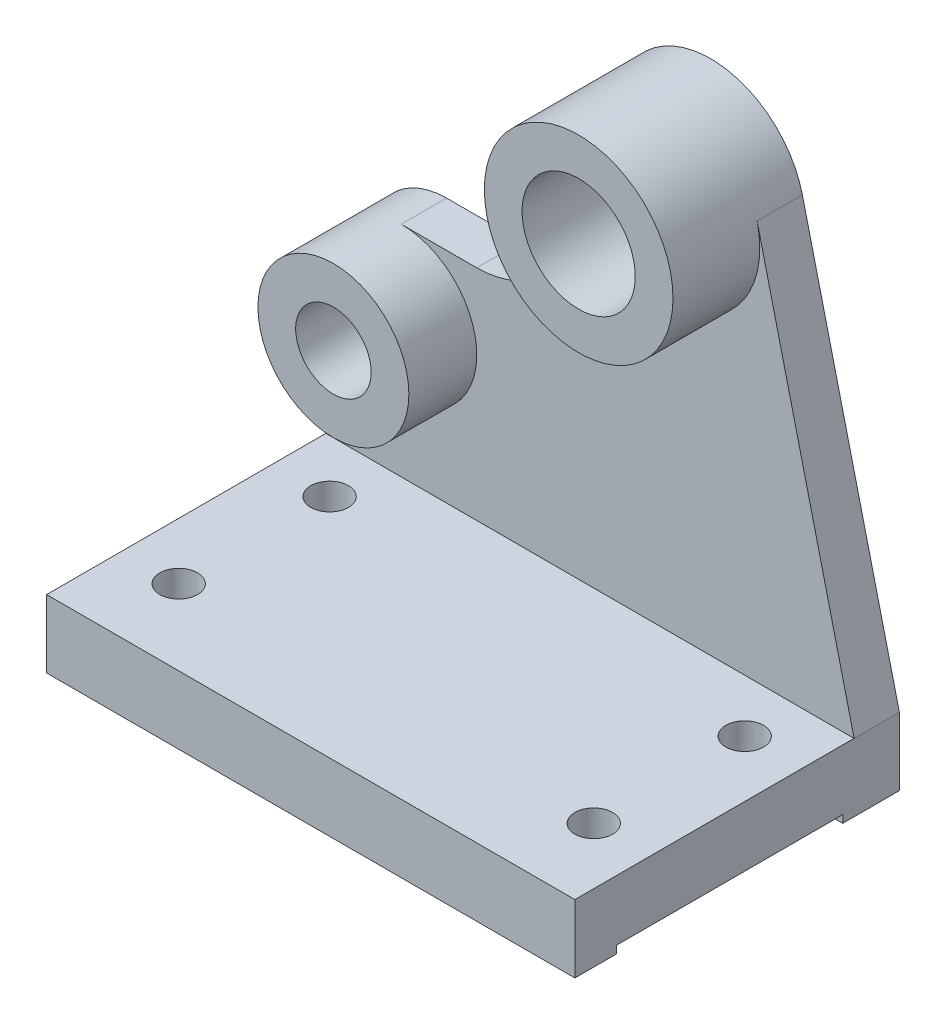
ISO-10303-21;
HEADER;
FILE_DESCRIPTION(('STEP AP214'),'2;1');
FILE_NAME('part.step','',(''),(''),'','','');
FILE_SCHEMA(('AUTOMOTIVE_DESIGN { 1 0 10303 214 1 1 1 1 }'));
ENDSEC;
DATA;
#1=APPLICATION_CONTEXT('core data for automotive mechanical design processes');
#2=APPLICATION_PROTOCOL_DEFINITION('international standard','automotive_design',2000,#1);
#3=PRODUCT_CONTEXT('',#1,'mechanical');
#4=PRODUCT('Part','Part','',(#3));
#5=PRODUCT_RELATED_PRODUCT_CATEGORY('part','',(#4));
#6=PRODUCT_DEFINITION_FORMATION('','',#4);
#7=PRODUCT_DEFINITION_CONTEXT('part definition',#1,'design');
#8=PRODUCT_DEFINITION('design','',#6,#7);
#9=PRODUCT_DEFINITION_SHAPE('','',#8);
#10=(LENGTH_UNIT() NAMED_UNIT(*) SI_UNIT(.MILLI.,.METRE.));
#11=(NAMED_UNIT(*) PLANE_ANGLE_UNIT() SI_UNIT($,.RADIAN.));
#12=(NAMED_UNIT(*) SI_UNIT($,.STERADIAN.) SOLID_ANGLE_UNIT());
#13=UNCERTAINTY_MEASURE_WITH_UNIT(LENGTH_MEASURE(1.E-05),#10,'distance_accuracy_value','');
#14=(GEOMETRIC_REPRESENTATION_CONTEXT(3) GLOBAL_UNCERTAINTY_ASSIGNED_CONTEXT((#13)) GLOBAL_UNIT_ASSIGNED_CONTEXT((#10,
#11,#12)) REPRESENTATION_CONTEXT('',''));
#15=CARTESIAN_POINT('',(0.,0.,0.));
#16=DIRECTION('',(0.,0.,1.));
#17=DIRECTION('',(1.,0.,0.));
#18=AXIS2_PLACEMENT_3D('',#15,#16,#17);
#19=CARTESIAN_POINT('',(82.4132243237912,0.,86.));
#20=DIRECTION('',(0.,1.,0.));
#21=DIRECTION('',(0.,0.,1.));
#22=AXIS2_PLACEMENT_3D('',#19,#20,#21);
#23=PLANE('',#22);
#24=DIRECTION('',(0.,0.,-1.));
#25=VECTOR('',#24,1.);
#26=CARTESIAN_POINT('',(0.,0.,86.));
#27=LINE('',#26,#25);
#28=CARTESIAN_POINT('',(0.,0.,86.));
#29=VERTEX_POINT('',#28);
#30=CARTESIAN_POINT('',(0.,0.,75.));
#31=VERTEX_POINT('',#30);
#32=EDGE_CURVE('E149',#29,#31,#27,.T.);
#33=ORIENTED_EDGE('',*,*,#32,.T.);
#34=DIRECTION('',(1.,0.,0.));
#35=VECTOR('',#34,1.);
#36=CARTESIAN_POINT('',(-5.00000000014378E-05,0.,75.));
#37=LINE('',#36,#35);
#38=CARTESIAN_POINT('',(140.,0.,75.));
#39=VERTEX_POINT('',#38);
#40=EDGE_CURVE('E133',#31,#39,#37,.T.);
#41=ORIENTED_EDGE('',*,*,#40,.T.);
#42=DIRECTION('',(0.,0.,-1.));
#43=VECTOR('',#42,1.);
#44=CARTESIAN_POINT('',(140.,0.,86.));
#45=LINE('',#44,#43);
#46=CARTESIAN_POINT('',(140.,0.,86.));
#47=VERTEX_POINT('',#46);
#48=EDGE_CURVE('E148',#47,#39,#45,.T.);
#49=ORIENTED_EDGE('',*,*,#48,.F.);
#50=DIRECTION('',(1.,0.,0.));
#51=VECTOR('',#50,1.);
#52=CARTESIAN_POINT('',(82.4132243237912,0.,86.));
#53=LINE('',#52,#51);
#54=EDGE_CURVE('E180',#29,#47,#53,.T.);
#55=ORIENTED_EDGE('',*,*,#54,.F.);
#56=EDGE_LOOP('',(#33,#41,#49,#55));
#57=FACE_BOUND('',#56,.T.);
#58=ADVANCED_FACE('F26',(#57),#23,.F.);
#59=CARTESIAN_POINT('',(140.,0.,15.));
#60=VERTEX_POINT('',#59);
#61=CARTESIAN_POINT('',(140.,0.,0.));
#62=VERTEX_POINT('',#61);
#63=EDGE_CURVE('E158',#60,#62,#45,.T.);
#64=ORIENTED_EDGE('',*,*,#63,.F.);
#65=DIRECTION('',(1.,0.,0.));
#66=VECTOR('',#65,1.);
#67=CARTESIAN_POINT('',(-5.00000000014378E-05,0.,15.));
#68=LINE('',#67,#66);
#69=CARTESIAN_POINT('',(0.,0.,15.));
#70=VERTEX_POINT('',#69);
#71=EDGE_CURVE('E150',#70,#60,#68,.T.);
#72=ORIENTED_EDGE('',*,*,#71,.F.);
#73=CARTESIAN_POINT('',(0.,0.,0.));
#74=VERTEX_POINT('',#73);
#75=EDGE_CURVE('E172',#70,#74,#27,.T.);
#76=ORIENTED_EDGE('',*,*,#75,.T.);
#77=DIRECTION('',(1.,0.,0.));
#78=VECTOR('',#77,1.);
#79=CARTESIAN_POINT('',(82.4132243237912,0.,0.));
#80=LINE('',#79,#78);
#81=EDGE_CURVE('E186',#74,#62,#80,.T.);
#82=ORIENTED_EDGE('',*,*,#81,.T.);
#83=EDGE_LOOP('',(#64,#72,#76,#82));
#84=FACE_BOUND('',#83,.T.);
#85=ADVANCED_FACE('F28',(#84),#23,.F.);
#86=CARTESIAN_POINT('',(140.,-157.009853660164,86.));
#87=DIRECTION('',(-1.,0.,0.));
#88=DIRECTION('',(0.,0.,1.));
#89=AXIS2_PLACEMENT_3D('',#86,#87,#88);
#90=PLANE('',#89);
#91=ORIENTED_EDGE('',*,*,#48,.T.);
#92=DIRECTION('',(0.,-1.,0.));
#93=VECTOR('',#92,1.);
#94=CARTESIAN_POINT('',(140.,0.,75.));
#95=LINE('',#94,#93);
#96=CARTESIAN_POINT('',(140.,2.,75.));
#97=VERTEX_POINT('',#96);
#98=EDGE_CURVE('E130',#97,#39,#95,.T.);
#99=ORIENTED_EDGE('',*,*,#98,.F.);
#100=DIRECTION('',(0.,0.,1.));
#101=VECTOR('',#100,1.);
#102=CARTESIAN_POINT('',(140.,2.,75.));
#103=LINE('',#102,#101);
#104=CARTESIAN_POINT('',(140.,2.,15.));
#105=VERTEX_POINT('',#104);
#106=EDGE_CURVE('E151',#105,#97,#103,.T.);
#107=ORIENTED_EDGE('',*,*,#106,.F.);
#108=DIRECTION('',(0.,1.,0.));
#109=VECTOR('',#108,1.);
#110=CARTESIAN_POINT('',(140.,0.,15.));
#111=LINE('',#110,#109);
#112=EDGE_CURVE('E141',#60,#105,#111,.T.);
#113=ORIENTED_EDGE('',*,*,#112,.F.);
#114=ORIENTED_EDGE('',*,*,#63,.T.);
#115=DIRECTION('',(0.,1.,0.));
#116=VECTOR('',#115,1.);
#117=CARTESIAN_POINT('',(140.,-157.009853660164,0.));
#118=LINE('',#117,#116);
#119=CARTESIAN_POINT('',(140.,18.,0.));
#120=VERTEX_POINT('',#119);
#121=EDGE_CURVE('E184',#62,#120,#118,.T.);
#122=ORIENTED_EDGE('',*,*,#121,.T.);
#123=DIRECTION('',(0.,0.,-1.));
#124=VECTOR('',#123,1.);
#125=CARTESIAN_POINT('',(140.,18.,12.));
#126=LINE('',#125,#124);
#127=CARTESIAN_POINT('',(140.,18.,12.));
#128=VERTEX_POINT('',#127);
#129=EDGE_CURVE('E200',#128,#120,#126,.T.);
#130=ORIENTED_EDGE('',*,*,#129,.F.);
#131=DIRECTION('',(0.,0.,-1.));
#132=VECTOR('',#131,1.);
#133=CARTESIAN_POINT('',(140.,18.,86.));
#134=LINE('',#133,#132);
#135=CARTESIAN_POINT('',(140.,18.,86.));
#136=VERTEX_POINT('',#135);
#137=EDGE_CURVE('E161',#136,#128,#134,.T.);
#138=ORIENTED_EDGE('',*,*,#137,.F.);
#139=DIRECTION('',(0.,1.,0.));
#140=VECTOR('',#139,1.);
#141=CARTESIAN_POINT('',(140.,-157.009853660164,86.));
#142=LINE('',#141,#140);
#143=EDGE_CURVE('E155',#47,#136,#142,.T.);
#144=ORIENTED_EDGE('',*,*,#143,.F.);
#145=EDGE_LOOP('',(#91,#99,#107,#113,#114,#122,#130,#138,#144));
#146=FACE_BOUND('',#145,.T.);
#147=ADVANCED_FACE('F153',(#146),#90,.F.);
#148=CARTESIAN_POINT('',(82.4132243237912,18.,86.));
#149=DIRECTION('',(0.,1.,0.));
#150=DIRECTION('',(0.,0.,1.));
#151=AXIS2_PLACEMENT_3D('',#148,#149,#150);
#152=PLANE('',#151);
#153=CARTESIAN_POINT('',(125.,18.,26.));
#154=DIRECTION('',(0.,1.,0.));
#155=DIRECTION('',(0.,0.,1.));
#156=AXIS2_PLACEMENT_3D('',#153,#154,#155);
#157=CIRCLE('',#156,5.);
#158=CARTESIAN_POINT('',(125.,18.,31.));
#159=VERTEX_POINT('',#158);
#160=EDGE_CURVE('E247',#159,#159,#157,.T.);
#161=ORIENTED_EDGE('',*,*,#160,.F.);
#162=EDGE_LOOP('',(#161));
#163=FACE_BOUND('',#162,.T.);
#164=CARTESIAN_POINT('',(15.,18.,26.));
#165=DIRECTION('',(0.,1.,0.));
#166=DIRECTION('',(0.,0.,1.));
#167=AXIS2_PLACEMENT_3D('',#164,#165,#166);
#168=CIRCLE('',#167,5.00000000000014);
#169=CARTESIAN_POINT('',(15.,18.,31.0000000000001));
#170=VERTEX_POINT('',#169);
#171=EDGE_CURVE('E237',#170,#170,#168,.T.);
#172=ORIENTED_EDGE('',*,*,#171,.F.);
#173=EDGE_LOOP('',(#172));
#174=FACE_BOUND('',#173,.T.);
#175=CARTESIAN_POINT('',(125.,18.,66.0000000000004));
#176=DIRECTION('',(0.,1.,0.));
#177=DIRECTION('',(0.,0.,1.));
#178=AXIS2_PLACEMENT_3D('',#175,#176,#177);
#179=CIRCLE('',#178,4.99999999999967);
#180=CARTESIAN_POINT('',(125.,18.,71.));
#181=VERTEX_POINT('',#180);
#182=EDGE_CURVE('E234',#181,#181,#179,.T.);
#183=ORIENTED_EDGE('',*,*,#182,.F.);
#184=EDGE_LOOP('',(#183));
#185=FACE_BOUND('',#184,.T.);
#186=CARTESIAN_POINT('',(15.,18.,66.));
#187=DIRECTION('',(0.,1.,0.));
#188=DIRECTION('',(0.,0.,1.));
#189=AXIS2_PLACEMENT_3D('',#186,#187,#188);
#190=CIRCLE('',#189,5.);
#191=CARTESIAN_POINT('',(15.,18.,71.));
#192=VERTEX_POINT('',#191);
#193=EDGE_CURVE('E231',#192,#192,#190,.T.);
#194=ORIENTED_EDGE('',*,*,#193,.F.);
#195=EDGE_LOOP('',(#194));
#196=FACE_BOUND('',#195,.T.);
#197=DIRECTION('',(1.,0.,0.));
#198=VECTOR('',#197,1.);
#199=CARTESIAN_POINT('',(82.4132243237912,18.,12.));
#200=LINE('',#199,#198);
#201=CARTESIAN_POINT('',(0.,18.,12.));
#202=VERTEX_POINT('',#201);
#203=EDGE_CURVE('E51',#202,#128,#200,.T.);
#204=ORIENTED_EDGE('',*,*,#203,.F.);
#205=DIRECTION('',(0.,0.,-1.));
#206=VECTOR('',#205,1.);
#207=CARTESIAN_POINT('',(0.,18.,86.));
#208=LINE('',#207,#206);
#209=CARTESIAN_POINT('',(0.,18.,86.));
#210=VERTEX_POINT('',#209);
#211=EDGE_CURVE('E166',#210,#202,#208,.T.);
#212=ORIENTED_EDGE('',*,*,#211,.F.);
#213=DIRECTION('',(1.,0.,0.));
#214=VECTOR('',#213,1.);
#215=CARTESIAN_POINT('',(82.4132243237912,18.,86.));
#216=LINE('',#215,#214);
#217=EDGE_CURVE('E176',#210,#136,#216,.T.);
#218=ORIENTED_EDGE('',*,*,#217,.T.);
#219=ORIENTED_EDGE('',*,*,#137,.T.);
#220=EDGE_LOOP('',(#204,#212,#218,#219));
#221=FACE_BOUND('',#220,.T.);
#222=ADVANCED_FACE('F313',(#163,#174,#185,#196,#221),#152,.T.);
#223=CARTESIAN_POINT('',(0.,-157.009853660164,86.));
#224=DIRECTION('',(-1.,0.,0.));
#225=DIRECTION('',(0.,0.,1.));
#226=AXIS2_PLACEMENT_3D('',#223,#224,#225);
#227=PLANE('',#226);
#228=DIRECTION('',(0.,1.,0.));
#229=VECTOR('',#228,1.);
#230=CARTESIAN_POINT('',(0.,-157.009853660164,75.));
#231=LINE('',#230,#229);
#232=CARTESIAN_POINT('',(0.,2.,75.));
#233=VERTEX_POINT('',#232);
#234=EDGE_CURVE('E11',#31,#233,#231,.T.);
#235=ORIENTED_EDGE('',*,*,#234,.F.);
#236=ORIENTED_EDGE('',*,*,#32,.F.);
#237=DIRECTION('',(0.,1.,0.));
#238=VECTOR('',#237,1.);
#239=CARTESIAN_POINT('',(0.,-157.009853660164,86.));
#240=LINE('',#239,#238);
#241=EDGE_CURVE('E173',#29,#210,#240,.T.);
#242=ORIENTED_EDGE('',*,*,#241,.T.);
#243=ORIENTED_EDGE('',*,*,#211,.T.);
#244=DIRECTION('',(0.,1.,0.));
#245=VECTOR('',#244,1.);
#246=CARTESIAN_POINT('',(0.,-157.009853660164,12.));
#247=LINE('',#246,#245);
#248=CARTESIAN_POINT('',(0.,56.,12.));
#249=VERTEX_POINT('',#248);
#250=EDGE_CURVE('E215',#202,#249,#247,.T.);
#251=ORIENTED_EDGE('',*,*,#250,.T.);
#252=DIRECTION('',(0.,0.,-1.));
#253=VECTOR('',#252,1.);
#254=CARTESIAN_POINT('',(0.,56.,12.));
#255=LINE('',#254,#253);
#256=CARTESIAN_POINT('',(0.,56.,0.));
#257=VERTEX_POINT('',#256);
#258=EDGE_CURVE('E197',#249,#257,#255,.T.);
#259=ORIENTED_EDGE('',*,*,#258,.T.);
#260=DIRECTION('',(0.,1.,0.));
#261=VECTOR('',#260,1.);
#262=CARTESIAN_POINT('',(0.,-157.009853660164,0.));
#263=LINE('',#262,#261);
#264=EDGE_CURVE('E182',#74,#257,#263,.T.);
#265=ORIENTED_EDGE('',*,*,#264,.F.);
#266=ORIENTED_EDGE('',*,*,#75,.F.);
#267=DIRECTION('',(0.,-1.,0.));
#268=VECTOR('',#267,1.);
#269=CARTESIAN_POINT('',(0.,-157.009853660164,15.));
#270=LINE('',#269,#268);
#271=CARTESIAN_POINT('',(0.,2.,15.));
#272=VERTEX_POINT('',#271);
#273=EDGE_CURVE('E157',#272,#70,#270,.T.);
#274=ORIENTED_EDGE('',*,*,#273,.F.);
#275=DIRECTION('',(0.,0.,-1.));
#276=VECTOR('',#275,1.);
#277=CARTESIAN_POINT('',(0.,2.,86.));
#278=LINE('',#277,#276);
#279=EDGE_CURVE('E35',#233,#272,#278,.T.);
#280=ORIENTED_EDGE('',*,*,#279,.F.);
#281=EDGE_LOOP('',(#235,#236,#242,#243,#251,#259,#265,#266,#274,#280));
#282=FACE_BOUND('',#281,.T.);
#283=ADVANCED_FACE('F309',(#282),#227,.T.);
#284=CARTESIAN_POINT('',(82.4132243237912,-157.009853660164,86.));
#285=DIRECTION('',(0.,0.,1.));
#286=DIRECTION('',(1.,0.,0.));
#287=AXIS2_PLACEMENT_3D('',#284,#285,#286);
#288=PLANE('',#287);
#289=ORIENTED_EDGE('',*,*,#54,.T.);
#290=ORIENTED_EDGE('',*,*,#143,.T.);
#291=ORIENTED_EDGE('',*,*,#217,.F.);
#292=ORIENTED_EDGE('',*,*,#241,.F.);
#293=EDGE_LOOP('',(#289,#290,#291,#292));
#294=FACE_BOUND('',#293,.T.);
#295=ADVANCED_FACE('F315',(#294),#288,.T.);
#296=CARTESIAN_POINT('',(82.4132243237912,-157.009853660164,0.));
#297=DIRECTION('',(0.,0.,1.));
#298=DIRECTION('',(1.,0.,0.));
#299=AXIS2_PLACEMENT_3D('',#296,#297,#298);
#300=PLANE('',#299);
#301=ORIENTED_EDGE('',*,*,#81,.F.);
#302=ORIENTED_EDGE('',*,*,#264,.T.);
#303=CARTESIAN_POINT('',(20.,56.,0.));
#304=DIRECTION('',(0.,0.,1.));
#305=DIRECTION('',(1.,0.,0.));
#306=AXIS2_PLACEMENT_3D('',#303,#304,#305);
#307=CIRCLE('',#306,20.);
#308=CARTESIAN_POINT('',(20.,76.,0.));
#309=VERTEX_POINT('',#308);
#310=EDGE_CURVE('E272',#309,#257,#307,.T.);
#311=ORIENTED_EDGE('',*,*,#310,.F.);
#312=DIRECTION('',(1.,0.,0.));
#313=VECTOR('',#312,1.);
#314=CARTESIAN_POINT('',(82.4132243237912,76.,0.));
#315=LINE('',#314,#313);
#316=CARTESIAN_POINT('',(40.,76.,0.));
#317=VERTEX_POINT('',#316);
#318=EDGE_CURVE('E287',#309,#317,#315,.T.);
#319=ORIENTED_EDGE('',*,*,#318,.T.);
#320=CARTESIAN_POINT('',(40.,101.,0.));
#321=DIRECTION('',(0.,0.,1.));
#322=DIRECTION('',(1.,0.,0.));
#323=AXIS2_PLACEMENT_3D('',#320,#321,#322);
#324=CIRCLE('',#323,25.);
#325=CARTESIAN_POINT('',(65.,101.,0.));
#326=VERTEX_POINT('',#325);
#327=EDGE_CURVE('E284',#326,#317,#324,.F.);
#328=ORIENTED_EDGE('',*,*,#327,.F.);
#329=DIRECTION('',(0.,-1.,0.));
#330=VECTOR('',#329,1.);
#331=CARTESIAN_POINT('',(65.,-157.009853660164,0.));
#332=LINE('',#331,#330);
#333=CARTESIAN_POINT('',(65.,118.,0.));
#334=VERTEX_POINT('',#333);
#335=EDGE_CURVE('E281',#334,#326,#332,.T.);
#336=ORIENTED_EDGE('',*,*,#335,.F.);
#337=CARTESIAN_POINT('',(90.,118.,0.));
#338=DIRECTION('',(0.,0.,1.));
#339=DIRECTION('',(1.,0.,0.));
#340=AXIS2_PLACEMENT_3D('',#337,#338,#339);
#341=CIRCLE('',#340,25.);
#342=CARTESIAN_POINT('',(114.294494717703,123.897247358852,0.));
#343=VERTEX_POINT('',#342);
#344=EDGE_CURVE('E260',#343,#334,#341,.T.);
#345=ORIENTED_EDGE('',*,*,#344,.F.);
#346=DIRECTION('',(-0.235889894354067,0.971779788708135,0.));
#347=VECTOR('',#346,1.);
#348=CARTESIAN_POINT('',(176.913678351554,-134.070806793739,0.));
#349=LINE('',#348,#347);
#350=EDGE_CURVE('E290',#120,#343,#349,.T.);
#351=ORIENTED_EDGE('',*,*,#350,.F.);
#352=ORIENTED_EDGE('',*,*,#121,.F.);
#353=EDGE_LOOP('',(#301,#302,#311,#319,#328,#336,#345,#351,#352));
#354=FACE_BOUND('',#353,.T.);
#355=CARTESIAN_POINT('',(20.,56.,0.));
#356=DIRECTION('',(0.,0.,1.));
#357=DIRECTION('',(1.,0.,0.));
#358=AXIS2_PLACEMENT_3D('',#355,#356,#357);
#359=CIRCLE('',#358,10.);
#360=CARTESIAN_POINT('',(30.,56.,0.));
#361=VERTEX_POINT('',#360);
#362=EDGE_CURVE('E269',#361,#361,#359,.T.);
#363=ORIENTED_EDGE('',*,*,#362,.T.);
#364=EDGE_LOOP('',(#363));
#365=FACE_BOUND('',#364,.T.);
#366=CARTESIAN_POINT('',(90.,118.,0.));
#367=DIRECTION('',(0.,0.,1.));
#368=DIRECTION('',(1.,0.,0.));
#369=AXIS2_PLACEMENT_3D('',#366,#367,#368);
#370=CIRCLE('',#369,15.);
#371=CARTESIAN_POINT('',(105.,118.,0.));
#372=VERTEX_POINT('',#371);
#373=EDGE_CURVE('E255',#372,#372,#370,.T.);
#374=ORIENTED_EDGE('',*,*,#373,.T.);
#375=EDGE_LOOP('',(#374));
#376=FACE_BOUND('',#375,.T.);
#377=ADVANCED_FACE('F330',(#354,#365,#376),#300,.F.);
#378=CARTESIAN_POINT('',(65.,-157.009853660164,12.));
#379=DIRECTION('',(1.,0.,0.));
#380=DIRECTION('',(0.,0.,-1.));
#381=AXIS2_PLACEMENT_3D('',#378,#379,#380);
#382=PLANE('',#381);
#383=ORIENTED_EDGE('',*,*,#335,.T.);
#384=DIRECTION('',(0.,0.,-1.));
#385=VECTOR('',#384,1.);
#386=CARTESIAN_POINT('',(65.,101.,12.));
#387=LINE('',#386,#385);
#388=CARTESIAN_POINT('',(65.,101.,12.));
#389=VERTEX_POINT('',#388);
#390=EDGE_CURVE('E189',#389,#326,#387,.T.);
#391=ORIENTED_EDGE('',*,*,#390,.F.);
#392=DIRECTION('',(0.,-1.,0.));
#393=VECTOR('',#392,1.);
#394=CARTESIAN_POINT('',(65.,-157.009853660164,12.));
#395=LINE('',#394,#393);
#396=CARTESIAN_POINT('',(65.,118.,12.));
#397=VERTEX_POINT('',#396);
#398=EDGE_CURVE('E292',#397,#389,#395,.T.);
#399=ORIENTED_EDGE('',*,*,#398,.F.);
#400=DIRECTION('',(0.,0.,-1.));
#401=VECTOR('',#400,1.);
#402=CARTESIAN_POINT('',(65.,118.,12.));
#403=LINE('',#402,#401);
#404=EDGE_CURVE('E204',#397,#334,#403,.T.);
#405=ORIENTED_EDGE('',*,*,#404,.T.);
#406=EDGE_LOOP('',(#383,#391,#399,#405));
#407=FACE_BOUND('',#406,.T.);
#408=ADVANCED_FACE('F334',(#407),#382,.F.);
#409=CARTESIAN_POINT('',(40.,101.,12.));
#410=DIRECTION('',(0.,0.,-1.));
#411=DIRECTION('',(-1.,0.,0.));
#412=AXIS2_PLACEMENT_3D('',#409,#410,#411);
#413=CYLINDRICAL_SURFACE('',#412,25.);
#414=ORIENTED_EDGE('',*,*,#327,.T.);
#415=DIRECTION('',(0.,0.,-1.));
#416=VECTOR('',#415,1.);
#417=CARTESIAN_POINT('',(40.,76.,12.));
#418=LINE('',#417,#416);
#419=CARTESIAN_POINT('',(40.,76.,12.));
#420=VERTEX_POINT('',#419);
#421=EDGE_CURVE('E192',#420,#317,#418,.T.);
#422=ORIENTED_EDGE('',*,*,#421,.F.);
#423=CARTESIAN_POINT('',(40.,101.,12.));
#424=DIRECTION('',(0.,0.,1.));
#425=DIRECTION('',(1.,0.,0.));
#426=AXIS2_PLACEMENT_3D('',#423,#424,#425);
#427=CIRCLE('',#426,25.);
#428=EDGE_CURVE('E295',#389,#420,#427,.F.);
#429=ORIENTED_EDGE('',*,*,#428,.F.);
#430=ORIENTED_EDGE('',*,*,#390,.T.);
#431=EDGE_LOOP('',(#414,#422,#429,#430));
#432=FACE_BOUND('',#431,.T.);
#433=ADVANCED_FACE('F337',(#432),#413,.F.);
#434=CARTESIAN_POINT('',(82.4132243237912,76.,12.));
#435=DIRECTION('',(0.,1.,0.));
#436=DIRECTION('',(0.,0.,1.));
#437=AXIS2_PLACEMENT_3D('',#434,#435,#436);
#438=PLANE('',#437);
#439=ORIENTED_EDGE('',*,*,#318,.F.);
#440=DIRECTION('',(0.,0.,-1.));
#441=VECTOR('',#440,1.);
#442=CARTESIAN_POINT('',(20.,76.,12.));
#443=LINE('',#442,#441);
#444=CARTESIAN_POINT('',(20.,76.,12.));
#445=VERTEX_POINT('',#444);
#446=EDGE_CURVE('E194',#445,#309,#443,.T.);
#447=ORIENTED_EDGE('',*,*,#446,.F.);
#448=DIRECTION('',(1.,0.,0.));
#449=VECTOR('',#448,1.);
#450=CARTESIAN_POINT('',(82.4132243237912,76.,12.));
#451=LINE('',#450,#449);
#452=EDGE_CURVE('E296',#445,#420,#451,.T.);
#453=ORIENTED_EDGE('',*,*,#452,.T.);
#454=ORIENTED_EDGE('',*,*,#421,.T.);
#455=EDGE_LOOP('',(#439,#447,#453,#454));
#456=FACE_BOUND('',#455,.T.);
#457=ADVANCED_FACE('F338',(#456),#438,.T.);
#458=CARTESIAN_POINT('',(176.913678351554,-134.070806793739,12.));
#459=DIRECTION('',(-0.971779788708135,-0.235889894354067,0.));
#460=DIRECTION('',(0.235889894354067,-0.971779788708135,0.));
#461=AXIS2_PLACEMENT_3D('',#458,#459,#460);
#462=PLANE('',#461);
#463=ORIENTED_EDGE('',*,*,#350,.T.);
#464=DIRECTION('',(0.,0.,-1.));
#465=VECTOR('',#464,1.);
#466=CARTESIAN_POINT('',(114.294494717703,123.897247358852,12.));
#467=LINE('',#466,#465);
#468=CARTESIAN_POINT('',(114.294494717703,123.897247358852,12.));
#469=VERTEX_POINT('',#468);
#470=EDGE_CURVE('E201',#469,#343,#467,.T.);
#471=ORIENTED_EDGE('',*,*,#470,.F.);
#472=DIRECTION('',(-0.235889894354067,0.971779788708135,0.));
#473=VECTOR('',#472,1.);
#474=CARTESIAN_POINT('',(176.913678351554,-134.070806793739,12.));
#475=LINE('',#474,#473);
#476=EDGE_CURVE('E209',#128,#469,#475,.T.);
#477=ORIENTED_EDGE('',*,*,#476,.F.);
#478=ORIENTED_EDGE('',*,*,#129,.T.);
#479=EDGE_LOOP('',(#463,#471,#477,#478));
#480=FACE_BOUND('',#479,.T.);
#481=ADVANCED_FACE('F322',(#480),#462,.F.);
#482=CARTESIAN_POINT('',(82.4132243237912,-157.009853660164,12.));
#483=DIRECTION('',(0.,0.,1.));
#484=DIRECTION('',(1.,0.,0.));
#485=AXIS2_PLACEMENT_3D('',#482,#483,#484);
#486=PLANE('',#485);
#487=ORIENTED_EDGE('',*,*,#398,.T.);
#488=ORIENTED_EDGE('',*,*,#428,.T.);
#489=ORIENTED_EDGE('',*,*,#452,.F.);
#490=CARTESIAN_POINT('',(20.,56.,12.));
#491=DIRECTION('',(0.,0.,1.));
#492=DIRECTION('',(1.,0.,0.));
#493=AXIS2_PLACEMENT_3D('',#490,#491,#492);
#494=CIRCLE('',#493,20.);
#495=EDGE_CURVE('E212',#249,#445,#494,.T.);
#496=ORIENTED_EDGE('',*,*,#495,.F.);
#497=ORIENTED_EDGE('',*,*,#250,.F.);
#498=ORIENTED_EDGE('',*,*,#203,.T.);
#499=ORIENTED_EDGE('',*,*,#476,.T.);
#500=CARTESIAN_POINT('',(90.,118.,12.));
#501=DIRECTION('',(0.,0.,1.));
#502=DIRECTION('',(1.,0.,0.));
#503=AXIS2_PLACEMENT_3D('',#500,#501,#502);
#504=CIRCLE('',#503,25.);
#505=EDGE_CURVE('E206',#397,#469,#504,.T.);
#506=ORIENTED_EDGE('',*,*,#505,.F.);
#507=EDGE_LOOP('',(#487,#488,#489,#496,#497,#498,#499,#506));
#508=FACE_BOUND('',#507,.T.);
#509=ADVANCED_FACE('F307',(#508),#486,.T.);
#510=CARTESIAN_POINT('',(20.,56.,30.));
#511=DIRECTION('',(0.,0.,-1.));
#512=DIRECTION('',(-1.,0.,0.));
#513=AXIS2_PLACEMENT_3D('',#510,#511,#512);
#514=CYLINDRICAL_SURFACE('',#513,20.);
#515=CARTESIAN_POINT('',(20.,56.,30.));
#516=DIRECTION('',(0.,0.,1.));
#517=DIRECTION('',(1.,0.,0.));
#518=AXIS2_PLACEMENT_3D('',#515,#516,#517);
#519=CIRCLE('',#518,20.);
#520=CARTESIAN_POINT('',(40.,56.,30.));
#521=VERTEX_POINT('',#520);
#522=EDGE_CURVE('E278',#521,#521,#519,.T.);
#523=ORIENTED_EDGE('',*,*,#522,.F.);
#524=EDGE_LOOP('',(#523));
#525=FACE_BOUND('',#524,.T.);
#526=ORIENTED_EDGE('',*,*,#310,.T.);
#527=ORIENTED_EDGE('',*,*,#258,.F.);
#528=ORIENTED_EDGE('',*,*,#495,.T.);
#529=ORIENTED_EDGE('',*,*,#446,.T.);
#530=EDGE_LOOP('',(#526,#527,#528,#529));
#531=FACE_BOUND('',#530,.T.);
#532=ADVANCED_FACE('F303',(#525,#531),#514,.T.);
#533=CARTESIAN_POINT('',(20.,56.,30.));
#534=DIRECTION('',(0.,0.,-1.));
#535=DIRECTION('',(-1.,0.,0.));
#536=AXIS2_PLACEMENT_3D('',#533,#534,#535);
#537=CYLINDRICAL_SURFACE('',#536,10.);
#538=CARTESIAN_POINT('',(20.,56.,30.));
#539=DIRECTION('',(0.,0.,1.));
#540=DIRECTION('',(1.,0.,0.));
#541=AXIS2_PLACEMENT_3D('',#538,#539,#540);
#542=CIRCLE('',#541,10.);
#543=CARTESIAN_POINT('',(30.,56.,30.));
#544=VERTEX_POINT('',#543);
#545=EDGE_CURVE('E275',#544,#544,#542,.T.);
#546=ORIENTED_EDGE('',*,*,#545,.T.);
#547=EDGE_LOOP('',(#546));
#548=FACE_BOUND('',#547,.T.);
#549=ORIENTED_EDGE('',*,*,#362,.F.);
#550=EDGE_LOOP('',(#549));
#551=FACE_BOUND('',#550,.T.);
#552=ADVANCED_FACE('F392',(#548,#551),#537,.F.);
#553=CARTESIAN_POINT('',(82.4132243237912,-157.009853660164,30.));
#554=DIRECTION('',(0.,0.,1.));
#555=DIRECTION('',(1.,0.,0.));
#556=AXIS2_PLACEMENT_3D('',#553,#554,#555);
#557=PLANE('',#556);
#558=ORIENTED_EDGE('',*,*,#545,.F.);
#559=EDGE_LOOP('',(#558));
#560=FACE_BOUND('',#559,.T.);
#561=ORIENTED_EDGE('',*,*,#522,.T.);
#562=EDGE_LOOP('',(#561));
#563=FACE_BOUND('',#562,.T.);
#564=ADVANCED_FACE('F395',(#560,#563),#557,.T.);
#565=CARTESIAN_POINT('',(90.,118.,35.));
#566=DIRECTION('',(0.,0.,-1.));
#567=DIRECTION('',(-1.,0.,0.));
#568=AXIS2_PLACEMENT_3D('',#565,#566,#567);
#569=CYLINDRICAL_SURFACE('',#568,25.);
#570=CARTESIAN_POINT('',(90.,118.,35.));
#571=DIRECTION('',(0.,0.,1.));
#572=DIRECTION('',(1.,0.,0.));
#573=AXIS2_PLACEMENT_3D('',#570,#571,#572);
#574=CIRCLE('',#573,25.);
#575=CARTESIAN_POINT('',(115.,118.,35.));
#576=VERTEX_POINT('',#575);
#577=EDGE_CURVE('E266',#576,#576,#574,.T.);
#578=ORIENTED_EDGE('',*,*,#577,.F.);
#579=EDGE_LOOP('',(#578));
#580=FACE_BOUND('',#579,.T.);
#581=ORIENTED_EDGE('',*,*,#344,.T.);
#582=ORIENTED_EDGE('',*,*,#404,.F.);
#583=ORIENTED_EDGE('',*,*,#505,.T.);
#584=ORIENTED_EDGE('',*,*,#470,.T.);
#585=EDGE_LOOP('',(#581,#582,#583,#584));
#586=FACE_BOUND('',#585,.T.);
#587=ADVANCED_FACE('F325',(#580,#586),#569,.T.);
#588=CARTESIAN_POINT('',(90.,118.,35.));
#589=DIRECTION('',(0.,0.,-1.));
#590=DIRECTION('',(-1.,0.,0.));
#591=AXIS2_PLACEMENT_3D('',#588,#589,#590);
#592=CYLINDRICAL_SURFACE('',#591,15.);
#593=CARTESIAN_POINT('',(90.,118.,35.));
#594=DIRECTION('',(0.,0.,1.));
#595=DIRECTION('',(1.,0.,0.));
#596=AXIS2_PLACEMENT_3D('',#593,#594,#595);
#597=CIRCLE('',#596,15.);
#598=CARTESIAN_POINT('',(105.,118.,35.));
#599=VERTEX_POINT('',#598);
#600=EDGE_CURVE('E263',#599,#599,#597,.T.);
#601=ORIENTED_EDGE('',*,*,#600,.T.);
#602=EDGE_LOOP('',(#601));
#603=FACE_BOUND('',#602,.T.);
#604=ORIENTED_EDGE('',*,*,#373,.F.);
#605=EDGE_LOOP('',(#604));
#606=FACE_BOUND('',#605,.T.);
#607=ADVANCED_FACE('F403',(#603,#606),#592,.F.);
#608=CARTESIAN_POINT('',(82.4132243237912,-157.009853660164,35.));
#609=DIRECTION('',(0.,0.,1.));
#610=DIRECTION('',(1.,0.,0.));
#611=AXIS2_PLACEMENT_3D('',#608,#609,#610);
#612=PLANE('',#611);
#613=ORIENTED_EDGE('',*,*,#600,.F.);
#614=EDGE_LOOP('',(#613));
#615=FACE_BOUND('',#614,.T.);
#616=ORIENTED_EDGE('',*,*,#577,.T.);
#617=EDGE_LOOP('',(#616));
#618=FACE_BOUND('',#617,.T.);
#619=ADVANCED_FACE('F360',(#615,#618),#612,.T.);
#620=CARTESIAN_POINT('',(-5.00000000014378E-05,0.,75.));
#621=DIRECTION('',(0.,0.,1.));
#622=DIRECTION('',(1.,0.,0.));
#623=AXIS2_PLACEMENT_3D('',#620,#621,#622);
#624=PLANE('',#623);
#625=ORIENTED_EDGE('',*,*,#234,.T.);
#626=DIRECTION('',(1.,0.,0.));
#627=VECTOR('',#626,1.);
#628=CARTESIAN_POINT('',(-5.00000000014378E-05,2.,75.));
#629=LINE('',#628,#627);
#630=EDGE_CURVE('E136',#233,#97,#629,.T.);
#631=ORIENTED_EDGE('',*,*,#630,.T.);
#632=ORIENTED_EDGE('',*,*,#98,.T.);
#633=ORIENTED_EDGE('',*,*,#40,.F.);
#634=EDGE_LOOP('',(#625,#631,#632,#633));
#635=FACE_BOUND('',#634,.T.);
#636=ADVANCED_FACE('F132',(#635),#624,.F.);
#637=CARTESIAN_POINT('',(-5.00000000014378E-05,2.,75.));
#638=DIRECTION('',(0.,1.,0.));
#639=DIRECTION('',(0.,0.,1.));
#640=AXIS2_PLACEMENT_3D('',#637,#638,#639);
#641=PLANE('',#640);
#642=CARTESIAN_POINT('',(125.,2.,26.));
#643=DIRECTION('',(0.,1.,0.));
#644=DIRECTION('',(0.,0.,1.));
#645=AXIS2_PLACEMENT_3D('',#642,#643,#644);
#646=CIRCLE('',#645,5.);
#647=CARTESIAN_POINT('',(125.,2.,31.));
#648=VERTEX_POINT('',#647);
#649=EDGE_CURVE('E30',#648,#648,#646,.T.);
#650=ORIENTED_EDGE('',*,*,#649,.T.);
#651=EDGE_LOOP('',(#650));
#652=FACE_BOUND('',#651,.T.);
#653=CARTESIAN_POINT('',(15.,2.,26.));
#654=DIRECTION('',(0.,1.,0.));
#655=DIRECTION('',(0.,0.,1.));
#656=AXIS2_PLACEMENT_3D('',#653,#654,#655);
#657=CIRCLE('',#656,5.00000000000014);
#658=CARTESIAN_POINT('',(15.,2.,31.0000000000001));
#659=VERTEX_POINT('',#658);
#660=EDGE_CURVE('E235',#659,#659,#657,.T.);
#661=ORIENTED_EDGE('',*,*,#660,.T.);
#662=EDGE_LOOP('',(#661));
#663=FACE_BOUND('',#662,.T.);
#664=CARTESIAN_POINT('',(125.,2.,66.0000000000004));
#665=DIRECTION('',(0.,1.,0.));
#666=DIRECTION('',(0.,0.,1.));
#667=AXIS2_PLACEMENT_3D('',#664,#665,#666);
#668=CIRCLE('',#667,4.99999999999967);
#669=CARTESIAN_POINT('',(125.,2.,71.));
#670=VERTEX_POINT('',#669);
#671=EDGE_CURVE('E232',#670,#670,#668,.T.);
#672=ORIENTED_EDGE('',*,*,#671,.T.);
#673=EDGE_LOOP('',(#672));
#674=FACE_BOUND('',#673,.T.);
#675=CARTESIAN_POINT('',(15.,2.,66.));
#676=DIRECTION('',(0.,1.,0.));
#677=DIRECTION('',(0.,0.,1.));
#678=AXIS2_PLACEMENT_3D('',#675,#676,#677);
#679=CIRCLE('',#678,5.);
#680=CARTESIAN_POINT('',(15.,2.,71.));
#681=VERTEX_POINT('',#680);
#682=EDGE_CURVE('E142',#681,#681,#679,.T.);
#683=ORIENTED_EDGE('',*,*,#682,.T.);
#684=EDGE_LOOP('',(#683));
#685=FACE_BOUND('',#684,.T.);
#686=ORIENTED_EDGE('',*,*,#279,.T.);
#687=DIRECTION('',(1.,0.,0.));
#688=VECTOR('',#687,1.);
#689=CARTESIAN_POINT('',(-5.00000000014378E-05,2.,15.));
#690=LINE('',#689,#688);
#691=EDGE_CURVE('E43',#272,#105,#690,.T.);
#692=ORIENTED_EDGE('',*,*,#691,.T.);
#693=ORIENTED_EDGE('',*,*,#106,.T.);
#694=ORIENTED_EDGE('',*,*,#630,.F.);
#695=EDGE_LOOP('',(#686,#692,#693,#694));
#696=FACE_BOUND('',#695,.T.);
#697=ADVANCED_FACE('F348',(#652,#663,#674,#685,#696),#641,.F.);
#698=CARTESIAN_POINT('',(-5.00000000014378E-05,0.,15.));
#699=DIRECTION('',(0.,0.,-1.));
#700=DIRECTION('',(-1.,0.,0.));
#701=AXIS2_PLACEMENT_3D('',#698,#699,#700);
#702=PLANE('',#701);
#703=ORIENTED_EDGE('',*,*,#273,.T.);
#704=ORIENTED_EDGE('',*,*,#71,.T.);
#705=ORIENTED_EDGE('',*,*,#112,.T.);
#706=ORIENTED_EDGE('',*,*,#691,.F.);
#707=EDGE_LOOP('',(#703,#704,#705,#706));
#708=FACE_BOUND('',#707,.T.);
#709=ADVANCED_FACE('F346',(#708),#702,.F.);
#710=CARTESIAN_POINT('',(15.,0.,66.));
#711=DIRECTION('',(0.,1.,0.));
#712=DIRECTION('',(0.,0.,1.));
#713=AXIS2_PLACEMENT_3D('',#710,#711,#712);
#714=CYLINDRICAL_SURFACE('',#713,5.);
#715=ORIENTED_EDGE('',*,*,#193,.T.);
#716=EDGE_LOOP('',(#715));
#717=FACE_BOUND('',#716,.T.);
#718=ORIENTED_EDGE('',*,*,#682,.F.);
#719=EDGE_LOOP('',(#718));
#720=FACE_BOUND('',#719,.T.);
#721=ADVANCED_FACE('F357',(#717,#720),#714,.F.);
#722=CARTESIAN_POINT('',(125.,0.,66.0000000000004));
#723=DIRECTION('',(0.,1.,0.));
#724=DIRECTION('',(0.,0.,1.));
#725=AXIS2_PLACEMENT_3D('',#722,#723,#724);
#726=CYLINDRICAL_SURFACE('',#725,4.99999999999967);
#727=ORIENTED_EDGE('',*,*,#182,.T.);
#728=EDGE_LOOP('',(#727));
#729=FACE_BOUND('',#728,.T.);
#730=ORIENTED_EDGE('',*,*,#671,.F.);
#731=EDGE_LOOP('',(#730));
#732=FACE_BOUND('',#731,.T.);
#733=ADVANCED_FACE('F505',(#729,#732),#726,.F.);
#734=CARTESIAN_POINT('',(15.,0.,26.));
#735=DIRECTION('',(0.,1.,0.));
#736=DIRECTION('',(0.,0.,1.));
#737=AXIS2_PLACEMENT_3D('',#734,#735,#736);
#738=CYLINDRICAL_SURFACE('',#737,5.00000000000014);
#739=ORIENTED_EDGE('',*,*,#171,.T.);
#740=EDGE_LOOP('',(#739));
#741=FACE_BOUND('',#740,.T.);
#742=ORIENTED_EDGE('',*,*,#660,.F.);
#743=EDGE_LOOP('',(#742));
#744=FACE_BOUND('',#743,.T.);
#745=ADVANCED_FACE('F512',(#741,#744),#738,.F.);
#746=CARTESIAN_POINT('',(125.,0.,26.));
#747=DIRECTION('',(0.,1.,0.));
#748=DIRECTION('',(0.,0.,1.));
#749=AXIS2_PLACEMENT_3D('',#746,#747,#748);
#750=CYLINDRICAL_SURFACE('',#749,5.);
#751=ORIENTED_EDGE('',*,*,#160,.T.);
#752=EDGE_LOOP('',(#751));
#753=FACE_BOUND('',#752,.T.);
#754=ORIENTED_EDGE('',*,*,#649,.F.);
#755=EDGE_LOOP('',(#754));
#756=FACE_BOUND('',#755,.T.);
#757=ADVANCED_FACE('F520',(#753,#756),#750,.F.);
#758=CLOSED_SHELL('',(#58,#85,#147,#222,#283,#295,#377,#408,#433,#457,#481,#509,#532,#552,#564,
#587,#607,#619,#636,#697,#709,#721,#733,#745,#757));
#759=MANIFOLD_SOLID_BREP('B2',#758);
#760=ADVANCED_BREP_SHAPE_REPRESENTATION('',(#18,#759),#14);
#761=SHAPE_DEFINITION_REPRESENTATION(#9,#760);
ENDSEC;
END-ISO-10303-21;
